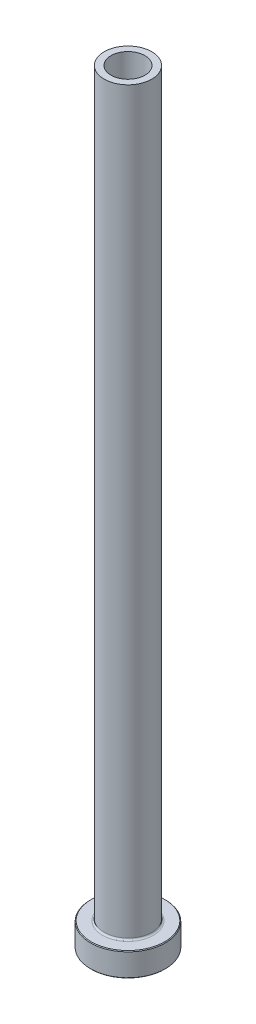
from build123d import *

# Parameters (mm, degrees)
FILLET1_R     = 0.5
CHAMFER1_SIZE = 0.2
CHAMFER3_SIZE = 0.5


with BuildPart() as part:
    # Sketch1 → Revolve1 (revolve)
    with BuildSketch(Plane.XY, mode=Mode.PRIVATE) as revolve1_sk:
        Polygon((-5, 225), (-7, 225), (-7, 7), (-11, 7), (-11, 0), (-5.25, 0), (-5.25, 168), (-5, 180), align=None)
    revolve(revolve1_sk.sketch.rotate(Axis((0, 92.187680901, 0), (0, -1, 0)), 270), axis=Axis((0, 92.187680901, 0), (0, -1, 0)))

    # Fillet1
    fillet1_edges = [part.edges().sort_by_distance(p)[0] for p in [
        (0, 7, -7),
    ]]
    fillet(fillet1_edges, radius=FILLET1_R)

    # Chamfer1
    chamfer1_edges = [part.edges().sort_by_distance(p)[0] for p in [
        (0, 0, -11),
        (0, 7, -11),
    ]]
    chamfer(chamfer1_edges, length=CHAMFER1_SIZE)

    # Chamfer3
    chamfer3_edges = [part.edges().sort_by_distance(p)[0] for p in [
        (0, 0, -5.25),
    ]]
    chamfer(chamfer3_edges, length=CHAMFER3_SIZE)


solid = part.part
